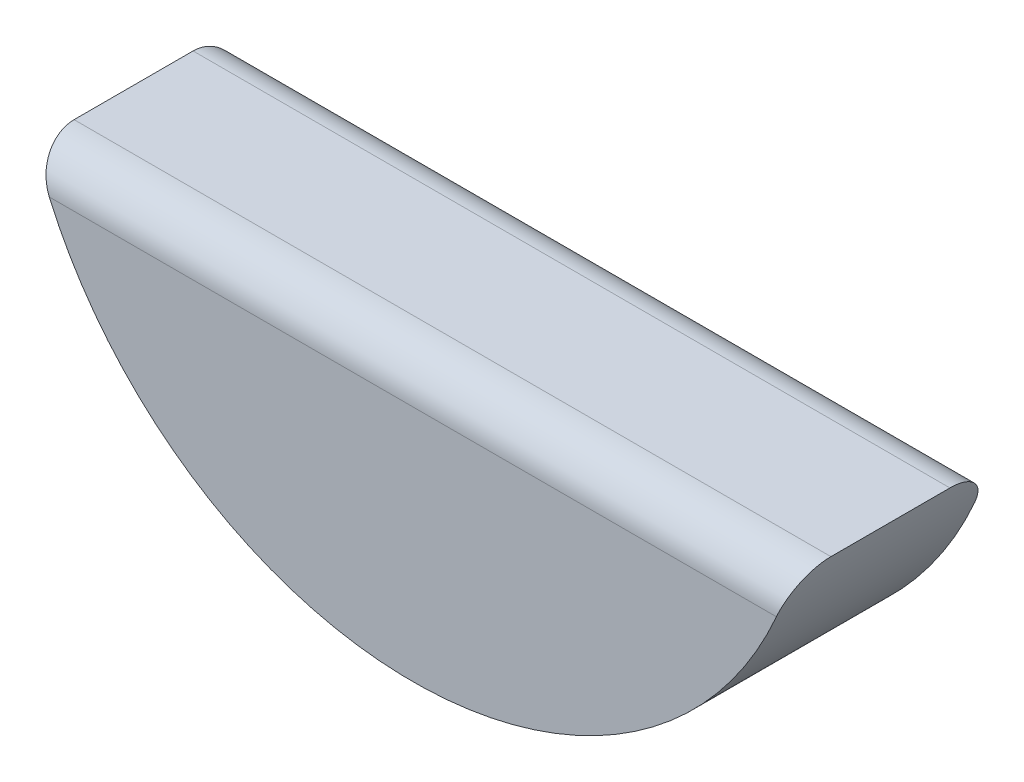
ISO-10303-21;
HEADER;
FILE_DESCRIPTION(('STEP AP214'),'2;1');
FILE_NAME('part.step','',(''),(''),'','','');
FILE_SCHEMA(('AUTOMOTIVE_DESIGN { 1 0 10303 214 1 1 1 1 }'));
ENDSEC;
DATA;
#1=APPLICATION_CONTEXT('core data for automotive mechanical design processes');
#2=APPLICATION_PROTOCOL_DEFINITION('international standard','automotive_design',2000,#1);
#3=PRODUCT_CONTEXT('',#1,'mechanical');
#4=PRODUCT('Part','Part','',(#3));
#5=PRODUCT_RELATED_PRODUCT_CATEGORY('part','',(#4));
#6=PRODUCT_DEFINITION_FORMATION('','',#4);
#7=PRODUCT_DEFINITION_CONTEXT('part definition',#1,'design');
#8=PRODUCT_DEFINITION('design','',#6,#7);
#9=PRODUCT_DEFINITION_SHAPE('','',#8);
#10=(LENGTH_UNIT() NAMED_UNIT(*) SI_UNIT(.MILLI.,.METRE.));
#11=(NAMED_UNIT(*) PLANE_ANGLE_UNIT() SI_UNIT($,.RADIAN.));
#12=(NAMED_UNIT(*) SI_UNIT($,.STERADIAN.) SOLID_ANGLE_UNIT());
#13=UNCERTAINTY_MEASURE_WITH_UNIT(LENGTH_MEASURE(1.E-05),#10,'distance_accuracy_value','');
#14=(GEOMETRIC_REPRESENTATION_CONTEXT(3) GLOBAL_UNCERTAINTY_ASSIGNED_CONTEXT((#13)) GLOBAL_UNIT_ASSIGNED_CONTEXT((#10,
#11,#12)) REPRESENTATION_CONTEXT('',''));
#15=CARTESIAN_POINT('',(0.,0.,0.));
#16=DIRECTION('',(0.,0.,1.));
#17=DIRECTION('',(1.,0.,0.));
#18=AXIS2_PLACEMENT_3D('',#15,#16,#17);
#19=CARTESIAN_POINT('',(0.,0.6,0.5));
#20=DIRECTION('',(0.,0.,-1.));
#21=DIRECTION('',(-1.,0.,0.));
#22=AXIS2_PLACEMENT_3D('',#19,#20,#21);
#23=CYLINDRICAL_SURFACE('',#22,2.);
#24=DIRECTION('',(0.,0.,-1.));
#25=VECTOR('',#24,1.);
#26=CARTESIAN_POINT('',(-1.90787840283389,0.,0.5));
#27=LINE('',#26,#25);
#28=CARTESIAN_POINT('',(-1.90787840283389,0.,0.3));
#29=VERTEX_POINT('',#28);
#30=CARTESIAN_POINT('',(-1.90787840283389,0.,-0.3));
#31=VERTEX_POINT('',#30);
#32=EDGE_CURVE('E76',#29,#31,#27,.T.);
#33=ORIENTED_EDGE('',*,*,#32,.T.);
#34=CARTESIAN_POINT('',(-1.90787840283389,0.,-0.3));
#35=CARTESIAN_POINT('',(-1.90787929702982,1.1237300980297E-05,-0.310838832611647));
#36=CARTESIAN_POINT('',(-1.90760150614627,-0.000880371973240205,-0.321672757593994));
#37=CARTESIAN_POINT('',(-1.90649568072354,-0.0043841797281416,-0.343010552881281));
#38=CARTESIAN_POINT('',(-1.90566863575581,-0.00699328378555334,-0.35351498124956));
#39=CARTESIAN_POINT('',(-1.90347119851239,-0.0138481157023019,-0.373916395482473));
#40=CARTESIAN_POINT('',(-1.90210071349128,-0.0180941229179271,-0.38381327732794));
#41=CARTESIAN_POINT('',(-1.89883044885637,-0.028068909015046,-0.402732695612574));
#42=CARTESIAN_POINT('',(-1.89693062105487,-0.033797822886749,-0.411755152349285));
#43=CARTESIAN_POINT('',(-1.89259187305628,-0.0466393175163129,-0.428826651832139));
#44=CARTESIAN_POINT('',(-1.89014533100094,-0.0537712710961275,-0.436859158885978));
#45=CARTESIAN_POINT('',(-1.88476454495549,-0.0691253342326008,-0.451608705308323));
#46=CARTESIAN_POINT('',(-1.88183024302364,-0.077347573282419,-0.458325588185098));
#47=CARTESIAN_POINT('',(-1.87538381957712,-0.0950017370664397,-0.47057465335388));
#48=CARTESIAN_POINT('',(-1.87185226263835,-0.104470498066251,-0.476043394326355));
#49=CARTESIAN_POINT('',(-1.86437134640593,-0.1240368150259,-0.485329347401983));
#50=CARTESIAN_POINT('',(-1.860421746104,-0.1341347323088,-0.489145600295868));
#51=CARTESIAN_POINT('',(-1.85264663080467,-0.153522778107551,-0.494756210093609));
#52=CARTESIAN_POINT('',(-1.84885692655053,-0.162776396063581,-0.496729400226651));
#53=CARTESIAN_POINT('',(-1.8410789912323,-0.181365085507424,-0.499351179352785));
#54=CARTESIAN_POINT('',(-1.83709118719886,-0.190699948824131,-0.50000250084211));
#55=CARTESIAN_POINT('',(-1.83303027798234,-0.2,-0.5));
#56=B_SPLINE_CURVE_WITH_KNOTS('',3,(#34,#35,#36,#37,#38,#39,#40,#41,#42,#43,#44,#45,#46,#47,#48,
#49,#50,#51,#52,#53,#54,#55),.UNSPECIFIED.,.F.,.F.,(4,2,2,2,2,2,2,2,2,2,4),(0.,
0.0324689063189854,0.0648794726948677,0.0972955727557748,0.129714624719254,0.162617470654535,
0.195524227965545,0.229847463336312,0.264190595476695,0.294679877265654,0.325106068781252),.UNSPECIFIED.);
#57=CARTESIAN_POINT('',(-1.83303027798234,-0.2,-0.5));
#58=VERTEX_POINT('',#57);
#59=EDGE_CURVE('E117',#31,#58,#56,.T.);
#60=ORIENTED_EDGE('',*,*,#59,.T.);
#61=CARTESIAN_POINT('',(0.,0.6,-0.5));
#62=DIRECTION('',(0.,0.,1.));
#63=DIRECTION('',(1.,0.,0.));
#64=AXIS2_PLACEMENT_3D('',#61,#62,#63);
#65=CIRCLE('',#64,2.);
#66=CARTESIAN_POINT('',(1.83303027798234,-0.2,-0.5));
#67=VERTEX_POINT('',#66);
#68=EDGE_CURVE('E127',#58,#67,#65,.T.);
#69=ORIENTED_EDGE('',*,*,#68,.T.);
#70=CARTESIAN_POINT('',(1.83303027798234,-0.2,-0.5));
#71=CARTESIAN_POINT('',(1.83811554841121,-0.188360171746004,-0.500008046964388));
#72=CARTESIAN_POINT('',(1.84308537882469,-0.17665866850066,-0.498983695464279));
#73=CARTESIAN_POINT('',(1.85269058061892,-0.153452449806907,-0.494863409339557));
#74=CARTESIAN_POINT('',(1.85732509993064,-0.14194828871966,-0.491762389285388));
#75=CARTESIAN_POINT('',(1.8661397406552,-0.119492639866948,-0.483472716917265));
#76=CARTESIAN_POINT('',(1.87031883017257,-0.108542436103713,-0.478279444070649));
#77=CARTESIAN_POINT('',(1.87810805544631,-0.0876294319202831,-0.46589216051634));
#78=CARTESIAN_POINT('',(1.88171895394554,-0.0776653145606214,-0.458700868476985));
#79=CARTESIAN_POINT('',(1.88810914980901,-0.0596440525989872,-0.442951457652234));
#80=CARTESIAN_POINT('',(1.89092433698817,-0.051510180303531,-0.43449576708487));
#81=CARTESIAN_POINT('',(1.89593688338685,-0.0367763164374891,-0.416172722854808));
#82=CARTESIAN_POINT('',(1.89813416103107,-0.0301765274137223,-0.406305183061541));
#83=CARTESIAN_POINT('',(1.90176197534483,-0.0191390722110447,-0.386103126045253));
#84=CARTESIAN_POINT('',(1.90323119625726,-0.0145938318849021,-0.375834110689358));
#85=CARTESIAN_POINT('',(1.90557798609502,-0.0072787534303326,-0.354625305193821));
#86=CARTESIAN_POINT('',(1.906456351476,-0.00450652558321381,-0.343686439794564));
#87=CARTESIAN_POINT('',(1.90731682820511,-0.00178339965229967,-0.327204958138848));
#88=CARTESIAN_POINT('',(1.90752754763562,-0.00111477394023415,-0.321783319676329));
#89=CARTESIAN_POINT('',(1.90780815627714,-0.000223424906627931,-0.310908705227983));
#90=CARTESIAN_POINT('',(1.90787827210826,1.59450309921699E-08,-0.305455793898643));
#91=CARTESIAN_POINT('',(1.90787840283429,1.05018964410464E-13,-0.300000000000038));
#92=B_SPLINE_CURVE_WITH_KNOTS('',3,(#70,#71,#72,#73,#74,#75,#76,#77,#78,#79,#80,#81,#82,#83,#84,
#85,#86,#87,#88,#89,#90,#91),.UNSPECIFIED.,.F.,.F.,(4,2,2,2,2,2,2,2,2,2,4),(0.,
0.0380807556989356,0.0762551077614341,0.114514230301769,0.152721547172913,0.18873090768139,
0.22474501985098,0.258555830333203,0.292320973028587,0.30870405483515,0.325060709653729),.UNSPECIFIED.);
#93=CARTESIAN_POINT('',(1.90787840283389,0.,-0.3));
#94=VERTEX_POINT('',#93);
#95=EDGE_CURVE('E78',#67,#94,#92,.T.);
#96=ORIENTED_EDGE('',*,*,#95,.T.);
#97=DIRECTION('',(0.,0.,-1.));
#98=VECTOR('',#97,1.);
#99=CARTESIAN_POINT('',(1.90787840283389,0.,0.5));
#100=LINE('',#99,#98);
#101=CARTESIAN_POINT('',(1.90787840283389,0.,0.3));
#102=VERTEX_POINT('',#101);
#103=EDGE_CURVE('E87',#102,#94,#100,.T.);
#104=ORIENTED_EDGE('',*,*,#103,.F.);
#105=CARTESIAN_POINT('',(1.90787840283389,0.,0.3));
#106=CARTESIAN_POINT('',(1.90787929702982,1.1237300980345E-05,0.310838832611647));
#107=CARTESIAN_POINT('',(1.90760150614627,-0.000880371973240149,0.321672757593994));
#108=CARTESIAN_POINT('',(1.90649568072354,-0.00438417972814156,0.343010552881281));
#109=CARTESIAN_POINT('',(1.90566863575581,-0.00699328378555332,0.35351498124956));
#110=CARTESIAN_POINT('',(1.90347119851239,-0.0138481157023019,0.373916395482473));
#111=CARTESIAN_POINT('',(1.90210071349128,-0.0180941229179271,0.38381327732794));
#112=CARTESIAN_POINT('',(1.89883044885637,-0.028068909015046,0.402732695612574));
#113=CARTESIAN_POINT('',(1.89693062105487,-0.0337978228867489,0.411755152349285));
#114=CARTESIAN_POINT('',(1.89259187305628,-0.0466393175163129,0.428826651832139));
#115=CARTESIAN_POINT('',(1.89014533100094,-0.0537712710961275,0.436859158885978));
#116=CARTESIAN_POINT('',(1.88476454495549,-0.0691253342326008,0.451608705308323));
#117=CARTESIAN_POINT('',(1.88183024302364,-0.077347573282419,0.458325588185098));
#118=CARTESIAN_POINT('',(1.87538381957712,-0.0950017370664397,0.47057465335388));
#119=CARTESIAN_POINT('',(1.87185226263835,-0.104470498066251,0.476043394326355));
#120=CARTESIAN_POINT('',(1.86437134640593,-0.1240368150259,0.485329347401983));
#121=CARTESIAN_POINT('',(1.860421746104,-0.1341347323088,0.489145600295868));
#122=CARTESIAN_POINT('',(1.85264663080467,-0.153522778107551,0.494756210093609));
#123=CARTESIAN_POINT('',(1.84885692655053,-0.162776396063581,0.496729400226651));
#124=CARTESIAN_POINT('',(1.8410789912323,-0.181365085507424,0.499351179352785));
#125=CARTESIAN_POINT('',(1.83709118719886,-0.190699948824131,0.50000250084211));
#126=CARTESIAN_POINT('',(1.83303027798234,-0.2,0.5));
#127=B_SPLINE_CURVE_WITH_KNOTS('',3,(#105,#106,#107,#108,#109,#110,#111,#112,#113,#114,#115,
#116,#117,#118,#119,#120,#121,#122,#123,#124,#125,#126),.UNSPECIFIED.,.F.,.F.,(4,2,2,2,2,2,2,2,
2,2,4),(0.,0.0324689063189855,0.0648794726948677,0.0972955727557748,0.129714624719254,
0.162617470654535,0.195524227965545,0.229847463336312,0.264190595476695,0.294679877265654,
0.325106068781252),.UNSPECIFIED.);
#128=CARTESIAN_POINT('',(1.83303027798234,-0.2,0.5));
#129=VERTEX_POINT('',#128);
#130=EDGE_CURVE('E49',#102,#129,#127,.T.);
#131=ORIENTED_EDGE('',*,*,#130,.T.);
#132=CARTESIAN_POINT('',(0.,0.6,0.5));
#133=DIRECTION('',(0.,0.,1.));
#134=DIRECTION('',(1.,0.,0.));
#135=AXIS2_PLACEMENT_3D('',#132,#133,#134);
#136=CIRCLE('',#135,2.);
#137=CARTESIAN_POINT('',(-1.83303027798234,-0.2,0.5));
#138=VERTEX_POINT('',#137);
#139=EDGE_CURVE('E77',#138,#129,#136,.T.);
#140=ORIENTED_EDGE('',*,*,#139,.F.);
#141=CARTESIAN_POINT('',(-1.83303027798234,-0.2,0.5));
#142=CARTESIAN_POINT('',(-1.83811554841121,-0.188360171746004,0.500008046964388));
#143=CARTESIAN_POINT('',(-1.84308537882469,-0.17665866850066,0.498983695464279));
#144=CARTESIAN_POINT('',(-1.85269058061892,-0.153452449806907,0.494863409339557));
#145=CARTESIAN_POINT('',(-1.85732509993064,-0.14194828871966,0.491762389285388));
#146=CARTESIAN_POINT('',(-1.8661397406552,-0.119492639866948,0.483472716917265));
#147=CARTESIAN_POINT('',(-1.87031883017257,-0.108542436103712,0.478279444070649));
#148=CARTESIAN_POINT('',(-1.87810805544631,-0.0876294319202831,0.46589216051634));
#149=CARTESIAN_POINT('',(-1.88171895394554,-0.0776653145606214,0.458700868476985));
#150=CARTESIAN_POINT('',(-1.88810914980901,-0.0596440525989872,0.442951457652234));
#151=CARTESIAN_POINT('',(-1.89092433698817,-0.051510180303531,0.43449576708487));
#152=CARTESIAN_POINT('',(-1.89593688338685,-0.0367763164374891,0.416172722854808));
#153=CARTESIAN_POINT('',(-1.89813416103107,-0.0301765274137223,0.406305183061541));
#154=CARTESIAN_POINT('',(-1.90176197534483,-0.0191390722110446,0.386103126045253));
#155=CARTESIAN_POINT('',(-1.90323119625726,-0.0145938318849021,0.375834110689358));
#156=CARTESIAN_POINT('',(-1.90557798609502,-0.00727875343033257,0.354625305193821));
#157=CARTESIAN_POINT('',(-1.906456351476,-0.00450652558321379,0.343686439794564));
#158=CARTESIAN_POINT('',(-1.90731682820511,-0.00178339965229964,0.327204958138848));
#159=CARTESIAN_POINT('',(-1.90752754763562,-0.00111477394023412,0.321783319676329));
#160=CARTESIAN_POINT('',(-1.90780815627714,-0.000223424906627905,0.310908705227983));
#161=CARTESIAN_POINT('',(-1.90787827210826,1.5945031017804E-08,0.305455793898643));
#162=CARTESIAN_POINT('',(-1.90787840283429,1.05045222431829E-13,0.300000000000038));
#163=B_SPLINE_CURVE_WITH_KNOTS('',3,(#141,#142,#143,#144,#145,#146,#147,#148,#149,#150,#151,
#152,#153,#154,#155,#156,#157,#158,#159,#160,#161,#162),.UNSPECIFIED.,.F.,.F.,(4,2,2,2,2,2,2,2,
2,2,4),(0.,0.0380807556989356,0.0762551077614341,0.114514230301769,0.152721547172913,
0.18873090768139,0.22474501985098,0.258555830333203,0.292320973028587,0.30870405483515,
0.325060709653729),.UNSPECIFIED.);
#164=EDGE_CURVE('E57',#138,#29,#163,.T.);
#165=ORIENTED_EDGE('',*,*,#164,.T.);
#166=EDGE_LOOP('',(#33,#60,#69,#96,#104,#131,#140,#165));
#167=FACE_BOUND('',#166,.T.);
#168=ADVANCED_FACE('F33',(#167),#23,.T.);
#169=CARTESIAN_POINT('',(-1.90787840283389,0.,0.5));
#170=DIRECTION('',(0.,-1.,0.));
#171=DIRECTION('',(0.,0.,-1.));
#172=AXIS2_PLACEMENT_3D('',#169,#170,#171);
#173=PLANE('',#172);
#174=ORIENTED_EDGE('',*,*,#103,.T.);
#175=DIRECTION('',(-1.,0.,0.));
#176=VECTOR('',#175,1.);
#177=CARTESIAN_POINT('',(-1.90787840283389,0.,-0.3));
#178=LINE('',#177,#176);
#179=EDGE_CURVE('E86',#94,#31,#178,.T.);
#180=ORIENTED_EDGE('',*,*,#179,.T.);
#181=ORIENTED_EDGE('',*,*,#32,.F.);
#182=DIRECTION('',(-1.,0.,0.));
#183=VECTOR('',#182,1.);
#184=CARTESIAN_POINT('',(1.90787840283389,0.,0.3));
#185=LINE('',#184,#183);
#186=EDGE_CURVE('E84',#29,#102,#185,.F.);
#187=ORIENTED_EDGE('',*,*,#186,.T.);
#188=EDGE_LOOP('',(#174,#180,#181,#187));
#189=FACE_BOUND('',#188,.T.);
#190=ADVANCED_FACE('F83',(#189),#173,.F.);
#191=CARTESIAN_POINT('',(0.,0.6,0.5));
#192=DIRECTION('',(0.,0.,1.));
#193=DIRECTION('',(1.,0.,0.));
#194=AXIS2_PLACEMENT_3D('',#191,#192,#193);
#195=PLANE('',#194);
#196=ORIENTED_EDGE('',*,*,#139,.T.);
#197=DIRECTION('',(-1.,0.,0.));
#198=VECTOR('',#197,1.);
#199=CARTESIAN_POINT('',(-1.90787840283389,-0.2,0.5));
#200=LINE('',#199,#198);
#201=EDGE_CURVE('E11',#129,#138,#200,.T.);
#202=ORIENTED_EDGE('',*,*,#201,.T.);
#203=EDGE_LOOP('',(#196,#202));
#204=FACE_BOUND('',#203,.T.);
#205=ADVANCED_FACE('F136',(#204),#195,.T.);
#206=CARTESIAN_POINT('',(0.,0.6,-0.5));
#207=DIRECTION('',(0.,0.,1.));
#208=DIRECTION('',(1.,0.,0.));
#209=AXIS2_PLACEMENT_3D('',#206,#207,#208);
#210=PLANE('',#209);
#211=ORIENTED_EDGE('',*,*,#68,.F.);
#212=DIRECTION('',(-1.,0.,0.));
#213=VECTOR('',#212,1.);
#214=CARTESIAN_POINT('',(0.,-0.2,-0.5));
#215=LINE('',#214,#213);
#216=EDGE_CURVE('E42',#58,#67,#215,.F.);
#217=ORIENTED_EDGE('',*,*,#216,.T.);
#218=EDGE_LOOP('',(#211,#217));
#219=FACE_BOUND('',#218,.T.);
#220=ADVANCED_FACE('F126',(#219),#210,.F.);
#221=CARTESIAN_POINT('',(-1.90787840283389,-0.2,-0.3));
#222=DIRECTION('',(-1.,0.,0.));
#223=DIRECTION('',(0.,0.,1.));
#224=AXIS2_PLACEMENT_3D('',#221,#222,#223);
#225=CYLINDRICAL_SURFACE('',#224,0.2);
#226=ORIENTED_EDGE('',*,*,#95,.F.);
#227=ORIENTED_EDGE('',*,*,#216,.F.);
#228=ORIENTED_EDGE('',*,*,#59,.F.);
#229=ORIENTED_EDGE('',*,*,#179,.F.);
#230=EDGE_LOOP('',(#226,#227,#228,#229));
#231=FACE_BOUND('',#230,.T.);
#232=ADVANCED_FACE('F107',(#231),#225,.T.);
#233=CARTESIAN_POINT('',(0.,-0.2,0.3));
#234=DIRECTION('',(1.,0.,0.));
#235=DIRECTION('',(0.,0.,-1.));
#236=AXIS2_PLACEMENT_3D('',#233,#234,#235);
#237=CYLINDRICAL_SURFACE('',#236,0.2);
#238=ORIENTED_EDGE('',*,*,#130,.F.);
#239=ORIENTED_EDGE('',*,*,#186,.F.);
#240=ORIENTED_EDGE('',*,*,#164,.F.);
#241=ORIENTED_EDGE('',*,*,#201,.F.);
#242=EDGE_LOOP('',(#238,#239,#240,#241));
#243=FACE_BOUND('',#242,.T.);
#244=ADVANCED_FACE('F35',(#243),#237,.T.);
#245=CLOSED_SHELL('',(#168,#190,#205,#220,#232,#244));
#246=MANIFOLD_SOLID_BREP('B2',#245);
#247=ADVANCED_BREP_SHAPE_REPRESENTATION('',(#18,#246),#14);
#248=SHAPE_DEFINITION_REPRESENTATION(#9,#247);
ENDSEC;
END-ISO-10303-21;
